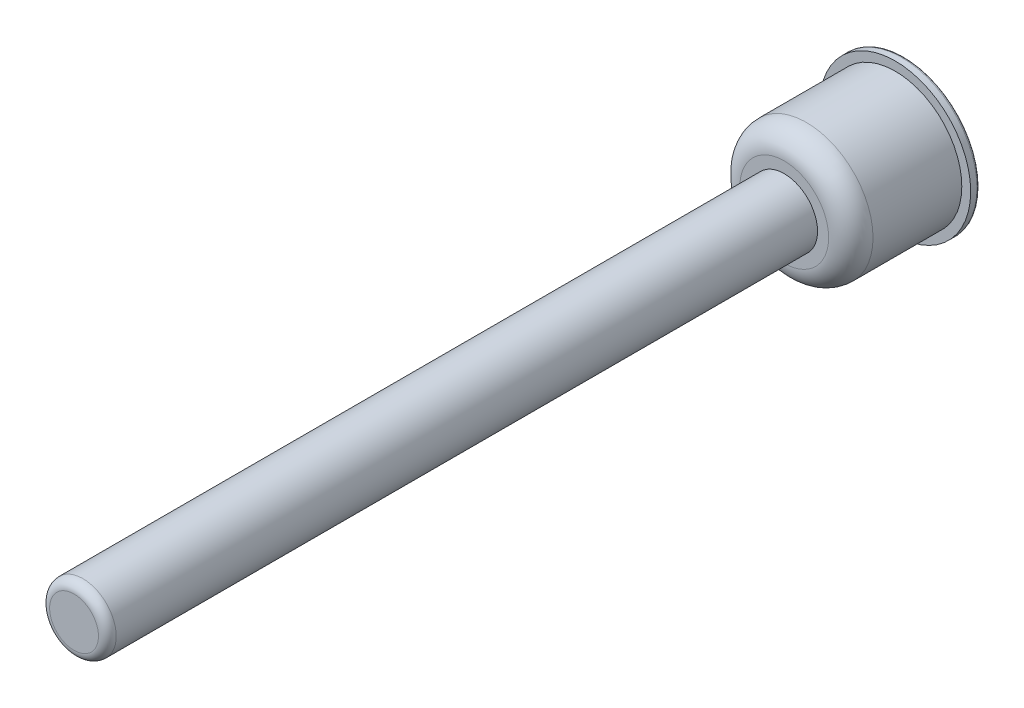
from build123d import *

# Parameters (mm, degrees)
SKETCH1_R           = 21.59
BOSS_EXTRUDE1_DEPTH = 2.54
SKETCH4_R           = 19.05
BOSS_EXTRUDE2_DEPTH = 31.75
SKETCH3_W           = 12.7
SKETCH3_H           = 12.7
CUT_EXTRUDE2_DEPTH  = 19.05
SKETCH5_R           = 9.525
BOSS_EXTRUDE3_DEPTH = 203.2
FILLET2_R           = 6.35
FILLET1_R           = 0.762
FILLET3_R           = 2.54


with BuildPart() as part:
    # Sketch1 → Boss-Extrude1 (new body)
    with BuildSketch(Plane.XY):
        Circle(SKETCH1_R)
    extrude(amount=BOSS_EXTRUDE1_DEPTH)

    # Sketch4 → Boss-Extrude2 (add)
    with BuildSketch(Plane.XY.offset(2.54)):
        Circle(SKETCH4_R)
    extrude(amount=BOSS_EXTRUDE2_DEPTH)

    # Sketch3 → Cut-Extrude2 (cut)
    with BuildSketch(Plane.XY):
        Rectangle(SKETCH3_W, SKETCH3_H)
    extrude(amount=CUT_EXTRUDE2_DEPTH, mode=Mode.SUBTRACT)

    # Sketch5 → Boss-Extrude3 (add)
    with BuildSketch(Plane.XY.offset(34.29)):
        Circle(SKETCH5_R)
    extrude(amount=BOSS_EXTRUDE3_DEPTH)

    # Fillet2
    fillet2_edges = [part.edges().sort_by_distance(p)[0] for p in [
        (-19.05, 0, 34.29),
    ]]
    fillet(fillet2_edges, radius=FILLET2_R)

    # Fillet1
    fillet1_edges = [part.edges().sort_by_distance(p)[0] for p in [
        (-21.59, 0, 0),
    ]]
    fillet(fillet1_edges, radius=FILLET1_R)

    # Fillet3
    fillet3_edges = [part.edges().sort_by_distance(p)[0] for p in [
        (-9.525, 0, 237.49),
    ]]
    fillet(fillet3_edges, radius=FILLET3_R)


solid = part.part
